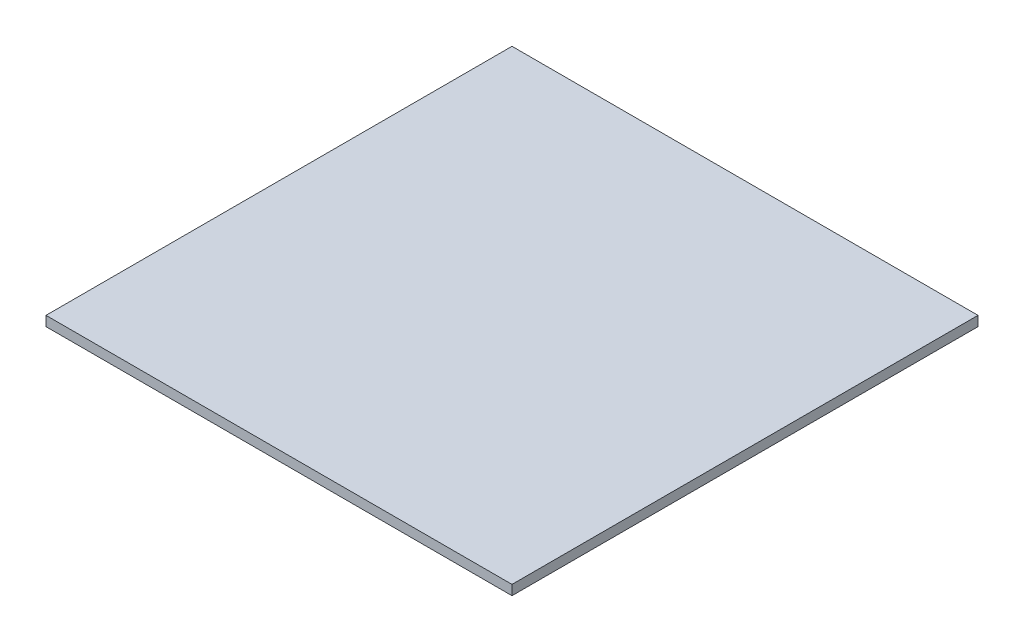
ISO-10303-21;
HEADER;
FILE_DESCRIPTION(('STEP AP214'),'2;1');
FILE_NAME('part.step','',(''),(''),'','','');
FILE_SCHEMA(('AUTOMOTIVE_DESIGN { 1 0 10303 214 1 1 1 1 }'));
ENDSEC;
DATA;
#1=APPLICATION_CONTEXT('core data for automotive mechanical design processes');
#2=APPLICATION_PROTOCOL_DEFINITION('international standard','automotive_design',2000,#1);
#3=PRODUCT_CONTEXT('',#1,'mechanical');
#4=PRODUCT('Part','Part','',(#3));
#5=PRODUCT_RELATED_PRODUCT_CATEGORY('part','',(#4));
#6=PRODUCT_DEFINITION_FORMATION('','',#4);
#7=PRODUCT_DEFINITION_CONTEXT('part definition',#1,'design');
#8=PRODUCT_DEFINITION('design','',#6,#7);
#9=PRODUCT_DEFINITION_SHAPE('','',#8);
#10=(LENGTH_UNIT() NAMED_UNIT(*) SI_UNIT(.MILLI.,.METRE.));
#11=(NAMED_UNIT(*) PLANE_ANGLE_UNIT() SI_UNIT($,.RADIAN.));
#12=(NAMED_UNIT(*) SI_UNIT($,.STERADIAN.) SOLID_ANGLE_UNIT());
#13=UNCERTAINTY_MEASURE_WITH_UNIT(LENGTH_MEASURE(1.E-05),#10,'distance_accuracy_value','');
#14=(GEOMETRIC_REPRESENTATION_CONTEXT(3) GLOBAL_UNCERTAINTY_ASSIGNED_CONTEXT((#13)) GLOBAL_UNIT_ASSIGNED_CONTEXT((#10,
#11,#12)) REPRESENTATION_CONTEXT('',''));
#15=CARTESIAN_POINT('',(0.,0.,0.));
#16=DIRECTION('',(0.,0.,1.));
#17=DIRECTION('',(1.,0.,0.));
#18=AXIS2_PLACEMENT_3D('',#15,#16,#17);
#19=CARTESIAN_POINT('',(-47.5,2.,-47.5));
#20=DIRECTION('',(1.,0.,0.));
#21=DIRECTION('',(0.,0.,-1.));
#22=AXIS2_PLACEMENT_3D('',#19,#20,#21);
#23=PLANE('',#22);
#24=DIRECTION('',(0.,0.,1.));
#25=VECTOR('',#24,1.);
#26=CARTESIAN_POINT('',(-47.5,0.,-47.5));
#27=LINE('',#26,#25);
#28=CARTESIAN_POINT('',(-47.5,0.,-47.5));
#29=VERTEX_POINT('',#28);
#30=CARTESIAN_POINT('',(-47.5,0.,47.5));
#31=VERTEX_POINT('',#30);
#32=EDGE_CURVE('E96',#29,#31,#27,.T.);
#33=ORIENTED_EDGE('',*,*,#32,.T.);
#34=DIRECTION('',(0.,-1.,0.));
#35=VECTOR('',#34,1.);
#36=CARTESIAN_POINT('',(-47.5,2.,47.5));
#37=LINE('',#36,#35);
#38=CARTESIAN_POINT('',(-47.5,2.,47.5));
#39=VERTEX_POINT('',#38);
#40=EDGE_CURVE('E11',#39,#31,#37,.T.);
#41=ORIENTED_EDGE('',*,*,#40,.F.);
#42=DIRECTION('',(0.,0.,1.));
#43=VECTOR('',#42,1.);
#44=CARTESIAN_POINT('',(-47.5,2.,-47.5));
#45=LINE('',#44,#43);
#46=CARTESIAN_POINT('',(-47.5,2.,-47.5));
#47=VERTEX_POINT('',#46);
#48=EDGE_CURVE('E84',#47,#39,#45,.T.);
#49=ORIENTED_EDGE('',*,*,#48,.F.);
#50=DIRECTION('',(0.,-1.,0.));
#51=VECTOR('',#50,1.);
#52=CARTESIAN_POINT('',(-47.5,2.,-47.5));
#53=LINE('',#52,#51);
#54=EDGE_CURVE('E92',#47,#29,#53,.T.);
#55=ORIENTED_EDGE('',*,*,#54,.T.);
#56=EDGE_LOOP('',(#33,#41,#49,#55));
#57=FACE_BOUND('',#56,.T.);
#58=ADVANCED_FACE('F33',(#57),#23,.F.);
#59=CARTESIAN_POINT('',(47.5,2.,47.5));
#60=DIRECTION('',(0.,0.,-1.));
#61=DIRECTION('',(-1.,0.,0.));
#62=AXIS2_PLACEMENT_3D('',#59,#60,#61);
#63=PLANE('',#62);
#64=DIRECTION('',(1.,0.,0.));
#65=VECTOR('',#64,1.);
#66=CARTESIAN_POINT('',(47.5,0.,47.5));
#67=LINE('',#66,#65);
#68=CARTESIAN_POINT('',(47.5,0.,47.5));
#69=VERTEX_POINT('',#68);
#70=EDGE_CURVE('E88',#31,#69,#67,.T.);
#71=ORIENTED_EDGE('',*,*,#70,.T.);
#72=DIRECTION('',(0.,-1.,0.));
#73=VECTOR('',#72,1.);
#74=CARTESIAN_POINT('',(47.5,2.,47.5));
#75=LINE('',#74,#73);
#76=CARTESIAN_POINT('',(47.5,2.,47.5));
#77=VERTEX_POINT('',#76);
#78=EDGE_CURVE('E41',#77,#69,#75,.T.);
#79=ORIENTED_EDGE('',*,*,#78,.F.);
#80=DIRECTION('',(1.,0.,0.));
#81=VECTOR('',#80,1.);
#82=CARTESIAN_POINT('',(47.5,2.,47.5));
#83=LINE('',#82,#81);
#84=EDGE_CURVE('E79',#39,#77,#83,.T.);
#85=ORIENTED_EDGE('',*,*,#84,.F.);
#86=ORIENTED_EDGE('',*,*,#40,.T.);
#87=EDGE_LOOP('',(#71,#79,#85,#86));
#88=FACE_BOUND('',#87,.T.);
#89=ADVANCED_FACE('F87',(#88),#63,.F.);
#90=CARTESIAN_POINT('',(47.5,2.,-47.5));
#91=DIRECTION('',(-1.,0.,0.));
#92=DIRECTION('',(0.,0.,1.));
#93=AXIS2_PLACEMENT_3D('',#90,#91,#92);
#94=PLANE('',#93);
#95=DIRECTION('',(0.,0.,-1.));
#96=VECTOR('',#95,1.);
#97=CARTESIAN_POINT('',(47.5,0.,-47.5));
#98=LINE('',#97,#96);
#99=CARTESIAN_POINT('',(47.5,0.,-47.5));
#100=VERTEX_POINT('',#99);
#101=EDGE_CURVE('E66',#69,#100,#98,.T.);
#102=ORIENTED_EDGE('',*,*,#101,.T.);
#103=DIRECTION('',(0.,-1.,0.));
#104=VECTOR('',#103,1.);
#105=CARTESIAN_POINT('',(47.5,2.,-47.5));
#106=LINE('',#105,#104);
#107=CARTESIAN_POINT('',(47.5,2.,-47.5));
#108=VERTEX_POINT('',#107);
#109=EDGE_CURVE('E89',#108,#100,#106,.T.);
#110=ORIENTED_EDGE('',*,*,#109,.F.);
#111=DIRECTION('',(0.,0.,-1.));
#112=VECTOR('',#111,1.);
#113=CARTESIAN_POINT('',(47.5,2.,-47.5));
#114=LINE('',#113,#112);
#115=EDGE_CURVE('E82',#77,#108,#114,.T.);
#116=ORIENTED_EDGE('',*,*,#115,.F.);
#117=ORIENTED_EDGE('',*,*,#78,.T.);
#118=EDGE_LOOP('',(#102,#110,#116,#117));
#119=FACE_BOUND('',#118,.T.);
#120=ADVANCED_FACE('F90',(#119),#94,.F.);
#121=CARTESIAN_POINT('',(47.5,2.,-47.5));
#122=DIRECTION('',(0.,0.,1.));
#123=DIRECTION('',(1.,0.,0.));
#124=AXIS2_PLACEMENT_3D('',#121,#122,#123);
#125=PLANE('',#124);
#126=DIRECTION('',(-1.,0.,0.));
#127=VECTOR('',#126,1.);
#128=CARTESIAN_POINT('',(47.5,0.,-47.5));
#129=LINE('',#128,#127);
#130=EDGE_CURVE('E72',#100,#29,#129,.T.);
#131=ORIENTED_EDGE('',*,*,#130,.T.);
#132=ORIENTED_EDGE('',*,*,#54,.F.);
#133=DIRECTION('',(-1.,0.,0.));
#134=VECTOR('',#133,1.);
#135=CARTESIAN_POINT('',(47.5,2.,-47.5));
#136=LINE('',#135,#134);
#137=EDGE_CURVE('E49',#108,#47,#136,.T.);
#138=ORIENTED_EDGE('',*,*,#137,.F.);
#139=ORIENTED_EDGE('',*,*,#109,.T.);
#140=EDGE_LOOP('',(#131,#132,#138,#139));
#141=FACE_BOUND('',#140,.T.);
#142=ADVANCED_FACE('F103',(#141),#125,.F.);
#143=CARTESIAN_POINT('',(0.,2.,0.));
#144=DIRECTION('',(0.,-1.,0.));
#145=DIRECTION('',(0.,0.,-1.));
#146=AXIS2_PLACEMENT_3D('',#143,#144,#145);
#147=PLANE('',#146);
#148=ORIENTED_EDGE('',*,*,#48,.T.);
#149=ORIENTED_EDGE('',*,*,#84,.T.);
#150=ORIENTED_EDGE('',*,*,#115,.T.);
#151=ORIENTED_EDGE('',*,*,#137,.T.);
#152=EDGE_LOOP('',(#148,#149,#150,#151));
#153=FACE_BOUND('',#152,.T.);
#154=ADVANCED_FACE('F80',(#153),#147,.F.);
#155=CARTESIAN_POINT('',(0.,0.,0.));
#156=DIRECTION('',(0.,-1.,0.));
#157=DIRECTION('',(0.,0.,-1.));
#158=AXIS2_PLACEMENT_3D('',#155,#156,#157);
#159=PLANE('',#158);
#160=ORIENTED_EDGE('',*,*,#32,.F.);
#161=ORIENTED_EDGE('',*,*,#130,.F.);
#162=ORIENTED_EDGE('',*,*,#101,.F.);
#163=ORIENTED_EDGE('',*,*,#70,.F.);
#164=EDGE_LOOP('',(#160,#161,#162,#163));
#165=FACE_BOUND('',#164,.T.);
#166=ADVANCED_FACE('F106',(#165),#159,.T.);
#167=CLOSED_SHELL('',(#58,#89,#120,#142,#154,#166));
#168=MANIFOLD_SOLID_BREP('B2',#167);
#169=ADVANCED_BREP_SHAPE_REPRESENTATION('',(#18,#168),#14);
#170=SHAPE_DEFINITION_REPRESENTATION(#9,#169);
ENDSEC;
END-ISO-10303-21;
